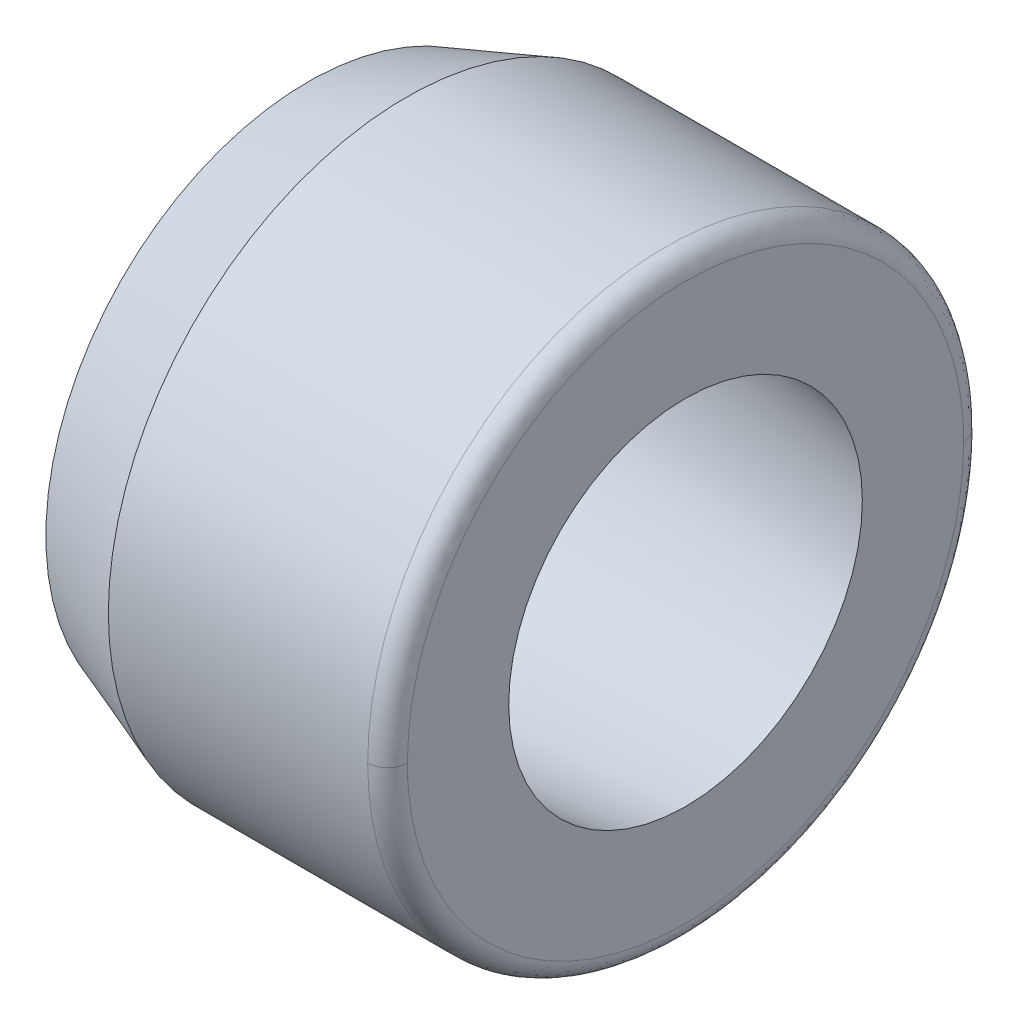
ISO-10303-21;
HEADER;
FILE_DESCRIPTION(('STEP AP214'),'2;1');
FILE_NAME('part.step','',(''),(''),'','','');
FILE_SCHEMA(('AUTOMOTIVE_DESIGN { 1 0 10303 214 1 1 1 1 }'));
ENDSEC;
DATA;
#1=APPLICATION_CONTEXT('core data for automotive mechanical design processes');
#2=APPLICATION_PROTOCOL_DEFINITION('international standard','automotive_design',2000,#1);
#3=PRODUCT_CONTEXT('',#1,'mechanical');
#4=PRODUCT('Part','Part','',(#3));
#5=PRODUCT_RELATED_PRODUCT_CATEGORY('part','',(#4));
#6=PRODUCT_DEFINITION_FORMATION('','',#4);
#7=PRODUCT_DEFINITION_CONTEXT('part definition',#1,'design');
#8=PRODUCT_DEFINITION('design','',#6,#7);
#9=PRODUCT_DEFINITION_SHAPE('','',#8);
#10=(LENGTH_UNIT() NAMED_UNIT(*) SI_UNIT(.MILLI.,.METRE.));
#11=(NAMED_UNIT(*) PLANE_ANGLE_UNIT() SI_UNIT($,.RADIAN.));
#12=(NAMED_UNIT(*) SI_UNIT($,.STERADIAN.) SOLID_ANGLE_UNIT());
#13=UNCERTAINTY_MEASURE_WITH_UNIT(LENGTH_MEASURE(1.E-05),#10,'distance_accuracy_value','');
#14=(GEOMETRIC_REPRESENTATION_CONTEXT(3) GLOBAL_UNCERTAINTY_ASSIGNED_CONTEXT((#13)) GLOBAL_UNIT_ASSIGNED_CONTEXT((#10,
#11,#12)) REPRESENTATION_CONTEXT('',''));
#15=CARTESIAN_POINT('',(0.,0.,0.));
#16=DIRECTION('',(0.,0.,1.));
#17=DIRECTION('',(1.,0.,0.));
#18=AXIS2_PLACEMENT_3D('',#15,#16,#17);
#19=CARTESIAN_POINT('',(0.320167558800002,0.,0.));
#20=DIRECTION('',(-1.,0.,0.));
#21=DIRECTION('',(0.,0.,1.));
#22=AXIS2_PLACEMENT_3D('',#19,#20,#21);
#23=CONICAL_SURFACE('',#22,1.3899511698,0.523598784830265);
#24=CARTESIAN_POINT('',(0.,0.,0.));
#25=DIRECTION('',(-1.,0.,0.));
#26=DIRECTION('',(0.,0.,1.));
#27=AXIS2_PLACEMENT_3D('',#24,#25,#26);
#28=CIRCLE('',#27,1.5748);
#29=CARTESIAN_POINT('',(0.,0.,1.5748));
#30=VERTEX_POINT('',#29);
#31=EDGE_CURVE('E21',#30,#30,#28,.F.);
#32=ORIENTED_EDGE('',*,*,#31,.F.);
#33=EDGE_LOOP('',(#32));
#34=FACE_BOUND('',#33,.T.);
#35=CARTESIAN_POINT('',(0.320167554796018,0.,0.));
#36=DIRECTION('',(-1.,0.,0.));
#37=DIRECTION('',(0.,-1.,0.));
#38=AXIS2_PLACEMENT_3D('',#35,#36,#37);
#39=CIRCLE('',#38,1.38995116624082);
#40=CARTESIAN_POINT('',(0.320167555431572,-1.42541794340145E-10,-1.38995116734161));
#41=VERTEX_POINT('',#40);
#42=CARTESIAN_POINT('',(0.32016755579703,-6.24045086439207E-11,1.3899511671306));
#43=VERTEX_POINT('',#42);
#44=EDGE_CURVE('E66',#41,#43,#39,.T.);
#45=ORIENTED_EDGE('',*,*,#44,.F.);
#46=CARTESIAN_POINT('',(0.320167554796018,0.,0.));
#47=DIRECTION('',(-1.,0.,0.));
#48=DIRECTION('',(0.,-1.,0.));
#49=AXIS2_PLACEMENT_3D('',#46,#47,#48);
#50=CIRCLE('',#49,1.38995116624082);
#51=EDGE_CURVE('E55',#43,#41,#50,.T.);
#52=ORIENTED_EDGE('',*,*,#51,.F.);
#53=EDGE_LOOP('',(#45,#52));
#54=FACE_BOUND('',#53,.T.);
#55=ADVANCED_FACE('F16',(#34,#54),#23,.F.);
#56=CARTESIAN_POINT('',(0.,-1.6965168,-1.6965168));
#57=DIRECTION('',(-1.,0.,0.));
#58=DIRECTION('',(0.,0.,1.));
#59=AXIS2_PLACEMENT_3D('',#56,#57,#58);
#60=PLANE('',#59);
#61=ORIENTED_EDGE('',*,*,#31,.T.);
#62=EDGE_LOOP('',(#61));
#63=FACE_BOUND('',#62,.T.);
#64=CARTESIAN_POINT('',(0.,0.,0.));
#65=DIRECTION('',(1.,0.,0.));
#66=DIRECTION('',(0.,0.,-1.));
#67=AXIS2_PLACEMENT_3D('',#64,#65,#66);
#68=CIRCLE('',#67,1.6764);
#69=CARTESIAN_POINT('',(0.,0.,-1.6764));
#70=VERTEX_POINT('',#69);
#71=EDGE_CURVE('E125',#70,#70,#68,.F.);
#72=ORIENTED_EDGE('',*,*,#71,.T.);
#73=EDGE_LOOP('',(#72));
#74=FACE_BOUND('',#73,.T.);
#75=ADVANCED_FACE('F195',(#63,#74),#60,.T.);
#76=CARTESIAN_POINT('',(0.443752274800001,0.,1.355944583));
#77=CARTESIAN_POINT('',(0.443752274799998,2.711889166,1.355944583));
#78=CARTESIAN_POINT('',(0.443752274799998,2.711889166,-1.355944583));
#79=CARTESIAN_POINT('',(0.443752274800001,0.,-1.355944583));
#80=CARTESIAN_POINT('',(0.391279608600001,0.,1.356650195));
#81=CARTESIAN_POINT('',(0.391279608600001,2.71330039,1.356650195));
#82=CARTESIAN_POINT('',(0.391279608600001,2.71330039,-1.356650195));
#83=CARTESIAN_POINT('',(0.391279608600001,0.,-1.356650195));
#84=CARTESIAN_POINT('',(0.341441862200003,0.,1.3730842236));
#85=CARTESIAN_POINT('',(0.341441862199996,2.7461684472,1.3730842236));
#86=CARTESIAN_POINT('',(0.341441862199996,2.7461684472,-1.3730842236));
#87=CARTESIAN_POINT('',(0.341441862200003,0.,-1.3730842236));
#88=CARTESIAN_POINT('',(0.298841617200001,0.,1.4037289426));
#89=CARTESIAN_POINT('',(0.298841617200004,2.8074579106,1.4037289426));
#90=CARTESIAN_POINT('',(0.298841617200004,2.8074579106,-1.4037289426));
#91=CARTESIAN_POINT('',(0.298841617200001,0.,-1.4037289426));
#92=(BOUNDED_SURFACE() B_SPLINE_SURFACE(3,3,((#76,#77,#78,#79),(#80,#81,#82,#83),(#84,#85,#86,
#87),(#88,#89,#90,#91)),.UNSPECIFIED.,.F.,.F.,.F.) B_SPLINE_SURFACE_WITH_KNOTS((4,4),(4,4),(0.,
1.),(0.,1.),.UNSPECIFIED.) GEOMETRIC_REPRESENTATION_ITEM() RATIONAL_B_SPLINE_SURFACE(((1.,
0.333333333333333,0.333333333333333,1.),(0.969216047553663,0.323072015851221,0.323072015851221,
0.969216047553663),(0.969216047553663,0.323072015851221,0.323072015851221,0.969216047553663),
(1.,0.333333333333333,0.333333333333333,1.))) REPRESENTATION_ITEM('') SURFACE());
#93=CARTESIAN_POINT('',(0.418413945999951,0.,0.));
#94=DIRECTION('',(-1.,0.,0.));
#95=DIRECTION('',(0.,0.,1.));
#96=AXIS2_PLACEMENT_3D('',#93,#94,#95);
#97=CIRCLE('',#96,1.3575543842);
#98=CARTESIAN_POINT('',(0.418413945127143,-1.82849395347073E-10,1.35755438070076));
#99=VERTEX_POINT('',#98);
#100=CARTESIAN_POINT('',(0.418413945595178,-4.17658529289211E-10,-1.35755438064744));
#101=VERTEX_POINT('',#100);
#102=EDGE_CURVE('E135',#99,#101,#97,.T.);
#103=CARTESIAN_POINT('',(0.443752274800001,0.,1.355944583));
#104=CARTESIAN_POINT('',(0.391279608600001,0.,1.356650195));
#105=CARTESIAN_POINT('',(0.341441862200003,0.,1.3730842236));
#106=CARTESIAN_POINT('',(0.298841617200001,0.,1.4037289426));
#107=(BOUNDED_CURVE() B_SPLINE_CURVE(3,(#103,#104,#105,#106),.UNSPECIFIED.,.F.,
.F.) B_SPLINE_CURVE_WITH_KNOTS((4,4),(0.,1.),
.UNSPECIFIED.) CURVE() GEOMETRIC_REPRESENTATION_ITEM() RATIONAL_B_SPLINE_CURVE((1.,
0.969216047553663,0.969216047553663,1.)) REPRESENTATION_ITEM(''));
#108=EDGE_CURVE('E63',#43,#99,#107,.F.);
#109=CARTESIAN_POINT('',(0.443752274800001,0.,-1.355944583));
#110=CARTESIAN_POINT('',(0.391279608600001,0.,-1.356650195));
#111=CARTESIAN_POINT('',(0.341441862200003,0.,-1.3730842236));
#112=CARTESIAN_POINT('',(0.298841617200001,0.,-1.4037289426));
#113=(BOUNDED_CURVE() B_SPLINE_CURVE(3,(#109,#110,#111,#112),.UNSPECIFIED.,.F.,
.F.) B_SPLINE_CURVE_WITH_KNOTS((4,4),(0.,1.),
.UNSPECIFIED.) CURVE() GEOMETRIC_REPRESENTATION_ITEM() RATIONAL_B_SPLINE_CURVE((1.,
0.969216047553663,0.969216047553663,1.)) REPRESENTATION_ITEM(''));
#114=EDGE_CURVE('E60',#101,#41,#113,.T.);
#115=ORIENTED_EDGE('',*,*,#102,.F.);
#116=ORIENTED_EDGE('',*,*,#108,.F.);
#117=ORIENTED_EDGE('',*,*,#51,.T.);
#118=ORIENTED_EDGE('',*,*,#114,.F.);
#119=EDGE_LOOP('',(#115,#116,#117,#118));
#120=FACE_BOUND('',#119,.T.);
#121=ADVANCED_FACE('F58',(#120),#92,.T.);
#122=CARTESIAN_POINT('',(0.443752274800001,0.,-1.355944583));
#123=CARTESIAN_POINT('',(0.443752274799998,-2.711889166,-1.355944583));
#124=CARTESIAN_POINT('',(0.443752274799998,-2.711889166,1.355944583));
#125=CARTESIAN_POINT('',(0.443752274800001,0.,1.355944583));
#126=CARTESIAN_POINT('',(0.391279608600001,0.,-1.356650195));
#127=CARTESIAN_POINT('',(0.391279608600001,-2.71330039,-1.356650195));
#128=CARTESIAN_POINT('',(0.391279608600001,-2.71330039,1.356650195));
#129=CARTESIAN_POINT('',(0.391279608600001,0.,1.356650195));
#130=CARTESIAN_POINT('',(0.341441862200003,0.,-1.3730842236));
#131=CARTESIAN_POINT('',(0.341441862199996,-2.7461684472,-1.3730842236));
#132=CARTESIAN_POINT('',(0.341441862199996,-2.7461684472,1.3730842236));
#133=CARTESIAN_POINT('',(0.341441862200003,0.,1.3730842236));
#134=CARTESIAN_POINT('',(0.298841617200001,0.,-1.4037289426));
#135=CARTESIAN_POINT('',(0.298841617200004,-2.8074579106,-1.4037289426));
#136=CARTESIAN_POINT('',(0.298841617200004,-2.8074579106,1.4037289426));
#137=CARTESIAN_POINT('',(0.298841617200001,0.,1.4037289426));
#138=(BOUNDED_SURFACE() B_SPLINE_SURFACE(3,3,((#122,#123,#124,#125),(#126,#127,#128,#129),(#130,
#131,#132,#133),(#134,#135,#136,#137)),.UNSPECIFIED.,.F.,.F.,
.F.) B_SPLINE_SURFACE_WITH_KNOTS((4,4),(4,4),(0.,1.),(0.,1.),
.UNSPECIFIED.) GEOMETRIC_REPRESENTATION_ITEM() RATIONAL_B_SPLINE_SURFACE(((1.,0.333333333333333,
0.333333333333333,1.),(0.969216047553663,0.323072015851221,0.323072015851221,0.969216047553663),
(0.969216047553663,0.323072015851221,0.323072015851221,0.969216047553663),(1.,0.333333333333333,
0.333333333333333,1.))) REPRESENTATION_ITEM('') SURFACE());
#139=CARTESIAN_POINT('',(0.418413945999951,0.,0.));
#140=DIRECTION('',(-1.,0.,0.));
#141=DIRECTION('',(0.,0.,1.));
#142=AXIS2_PLACEMENT_3D('',#139,#140,#141);
#143=CIRCLE('',#142,1.3575543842);
#144=EDGE_CURVE('E72',#101,#99,#143,.T.);
#145=ORIENTED_EDGE('',*,*,#108,.T.);
#146=ORIENTED_EDGE('',*,*,#144,.F.);
#147=ORIENTED_EDGE('',*,*,#114,.T.);
#148=ORIENTED_EDGE('',*,*,#44,.T.);
#149=EDGE_LOOP('',(#145,#146,#147,#148));
#150=FACE_BOUND('',#149,.T.);
#151=ADVANCED_FACE('F70',(#150),#138,.T.);
#152=CARTESIAN_POINT('',(0.,0.,0.));
#153=DIRECTION('',(1.,0.,0.));
#154=DIRECTION('',(0.,0.,-1.));
#155=AXIS2_PLACEMENT_3D('',#152,#153,#154);
#156=CONICAL_SURFACE('',#155,1.6764,0.349065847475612);
#157=ORIENTED_EDGE('',*,*,#71,.F.);
#158=EDGE_LOOP('',(#157));
#159=FACE_BOUND('',#158,.T.);
#160=CARTESIAN_POINT('',(0.628073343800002,0.,0.));
#161=DIRECTION('',(-1.,0.,0.));
#162=DIRECTION('',(0.,0.,1.));
#163=AXIS2_PLACEMENT_3D('',#160,#161,#162);
#164=CIRCLE('',#163,1.905);
#165=CARTESIAN_POINT('',(0.628073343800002,0.,1.905));
#166=VERTEX_POINT('',#165);
#167=EDGE_CURVE('E100',#166,#166,#164,.T.);
#168=ORIENTED_EDGE('',*,*,#167,.T.);
#169=EDGE_LOOP('',(#168));
#170=FACE_BOUND('',#169,.T.);
#171=ADVANCED_FACE('F172',(#159,#170),#156,.T.);
#172=CARTESIAN_POINT('',(2.4123655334,0.,1.7653211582));
#173=CARTESIAN_POINT('',(2.4123655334,-3.5306423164,1.7653211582));
#174=CARTESIAN_POINT('',(2.4123655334,-3.5306423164,-1.7653211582));
#175=CARTESIAN_POINT('',(2.4123655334,0.,-1.7653211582));
#176=CARTESIAN_POINT('',(2.4210289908,0.,1.8516668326));
#177=CARTESIAN_POINT('',(2.4210289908,-3.7033336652,1.8516668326));
#178=CARTESIAN_POINT('',(2.4210289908,-3.7033336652,-1.8516668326));
#179=CARTESIAN_POINT('',(2.4210289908,0.,-1.8516668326));
#180=CARTESIAN_POINT('',(2.3596668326,0.,1.9130289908));
#181=CARTESIAN_POINT('',(2.3596668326,-3.8260579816,1.9130289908));
#182=CARTESIAN_POINT('',(2.3596668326,-3.8260579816,-1.9130289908));
#183=CARTESIAN_POINT('',(2.3596668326,0.,-1.9130289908));
#184=CARTESIAN_POINT('',(2.2733211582,0.,1.9043655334));
#185=CARTESIAN_POINT('',(2.27332115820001,-3.8087310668,1.9043655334));
#186=CARTESIAN_POINT('',(2.27332115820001,-3.8087310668,-1.9043655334));
#187=CARTESIAN_POINT('',(2.2733211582,0.,-1.9043655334));
#188=(BOUNDED_SURFACE() B_SPLINE_SURFACE(3,3,((#172,#173,#174,#175),(#176,#177,#178,#179),(#180,
#181,#182,#183),(#184,#185,#186,#187)),.UNSPECIFIED.,.F.,.F.,
.F.) B_SPLINE_SURFACE_WITH_KNOTS((4,4),(4,4),(0.,1.),(0.,1.),
.UNSPECIFIED.) GEOMETRIC_REPRESENTATION_ITEM() RATIONAL_B_SPLINE_SURFACE(((1.,0.333333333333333,
0.333333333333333,1.),(0.755320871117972,0.251773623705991,0.251773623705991,0.755320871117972),
(0.755320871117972,0.251773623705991,0.251773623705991,0.755320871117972),(1.,0.333333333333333,
0.333333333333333,1.))) REPRESENTATION_ITEM('') SURFACE());
#189=CARTESIAN_POINT('',(2.4123655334,0.,-1.7653211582));
#190=CARTESIAN_POINT('',(2.4210289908,0.,-1.8516668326));
#191=CARTESIAN_POINT('',(2.3596668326,0.,-1.9130289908));
#192=CARTESIAN_POINT('',(2.2733211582,0.,-1.9043655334));
#193=(BOUNDED_CURVE() B_SPLINE_CURVE(3,(#189,#190,#191,#192),.UNSPECIFIED.,.F.,
.F.) B_SPLINE_CURVE_WITH_KNOTS((4,4),(0.,1.),
.UNSPECIFIED.) CURVE() GEOMETRIC_REPRESENTATION_ITEM() RATIONAL_B_SPLINE_CURVE((1.,
0.755320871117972,0.755320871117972,1.)) REPRESENTATION_ITEM(''));
#194=CARTESIAN_POINT('',(2.28600000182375,-1.95361088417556E-10,-1.90500000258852));
#195=VERTEX_POINT('',#194);
#196=CARTESIAN_POINT('',(2.41300000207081,0.,-1.77800000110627));
#197=VERTEX_POINT('',#196);
#198=EDGE_CURVE('E35',#195,#197,#193,.F.);
#199=CARTESIAN_POINT('',(2.41300000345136,0.,-1.77800000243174));
#200=CARTESIAN_POINT('',(2.41300000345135,-3.55600000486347,-1.77800000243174));
#201=CARTESIAN_POINT('',(2.41300000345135,-3.55600000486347,1.77800000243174));
#202=CARTESIAN_POINT('',(2.41300000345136,0.,1.77800000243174));
#203=(BOUNDED_CURVE() B_SPLINE_CURVE(3,(#199,#200,#201,#202),.UNSPECIFIED.,.F.,
.F.) B_SPLINE_CURVE_WITH_KNOTS((4,4),(0.,1.),
.UNSPECIFIED.) CURVE() GEOMETRIC_REPRESENTATION_ITEM() RATIONAL_B_SPLINE_CURVE((0.956578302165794,
0.318859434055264,0.318859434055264,0.956578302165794)) REPRESENTATION_ITEM(''));
#204=CARTESIAN_POINT('',(2.41300000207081,0.,1.77800000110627));
#205=VERTEX_POINT('',#204);
#206=EDGE_CURVE('E103',#205,#197,#203,.F.);
#207=CARTESIAN_POINT('',(2.4123655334,0.,1.7653211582));
#208=CARTESIAN_POINT('',(2.4210289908,0.,1.8516668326));
#209=CARTESIAN_POINT('',(2.3596668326,0.,1.9130289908));
#210=CARTESIAN_POINT('',(2.2733211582,0.,1.9043655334));
#211=(BOUNDED_CURVE() B_SPLINE_CURVE(3,(#207,#208,#209,#210),.UNSPECIFIED.,.F.,
.F.) B_SPLINE_CURVE_WITH_KNOTS((4,4),(0.,1.),
.UNSPECIFIED.) CURVE() GEOMETRIC_REPRESENTATION_ITEM() RATIONAL_B_SPLINE_CURVE((1.,
0.755320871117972,0.755320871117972,1.)) REPRESENTATION_ITEM(''));
#212=CARTESIAN_POINT('',(2.28600000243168,-8.55283725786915E-11,1.90500000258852));
#213=VERTEX_POINT('',#212);
#214=EDGE_CURVE('E93',#205,#213,#211,.T.);
#215=CARTESIAN_POINT('',(2.28600000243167,0.,0.));
#216=DIRECTION('',(1.,0.,0.));
#217=DIRECTION('',(0.,1.,0.));
#218=AXIS2_PLACEMENT_3D('',#215,#216,#217);
#219=CIRCLE('',#218,1.90500000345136);
#220=EDGE_CURVE('E91',#213,#195,#219,.T.);
#221=ORIENTED_EDGE('',*,*,#198,.T.);
#222=ORIENTED_EDGE('',*,*,#206,.F.);
#223=ORIENTED_EDGE('',*,*,#214,.T.);
#224=ORIENTED_EDGE('',*,*,#220,.T.);
#225=EDGE_LOOP('',(#221,#222,#223,#224));
#226=FACE_BOUND('',#225,.T.);
#227=ADVANCED_FACE('F159',(#226),#188,.T.);
#228=CARTESIAN_POINT('',(2.413,0.,0.));
#229=DIRECTION('',(-1.,0.,0.));
#230=DIRECTION('',(0.,0.,1.));
#231=AXIS2_PLACEMENT_3D('',#228,#229,#230);
#232=CONICAL_SURFACE('',#231,1.1303,0.113446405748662);
#233=ORIENTED_EDGE('',*,*,#102,.T.);
#234=ORIENTED_EDGE('',*,*,#144,.T.);
#235=EDGE_LOOP('',(#233,#234));
#236=FACE_BOUND('',#235,.T.);
#237=CARTESIAN_POINT('',(2.413,0.,0.));
#238=DIRECTION('',(-1.,0.,0.));
#239=DIRECTION('',(0.,0.,1.));
#240=AXIS2_PLACEMENT_3D('',#237,#238,#239);
#241=CIRCLE('',#240,1.1303);
#242=CARTESIAN_POINT('',(2.413,0.,1.1303));
#243=VERTEX_POINT('',#242);
#244=EDGE_CURVE('E88',#243,#243,#241,.T.);
#245=ORIENTED_EDGE('',*,*,#244,.F.);
#246=EDGE_LOOP('',(#245));
#247=FACE_BOUND('',#246,.T.);
#248=ADVANCED_FACE('F171',(#236,#247),#232,.F.);
#249=CARTESIAN_POINT('',(2.286,0.,0.));
#250=DIRECTION('',(-1.,0.,0.));
#251=DIRECTION('',(0.,0.,1.));
#252=AXIS2_PLACEMENT_3D('',#249,#250,#251);
#253=CYLINDRICAL_SURFACE('',#252,1.905);
#254=ORIENTED_EDGE('',*,*,#220,.F.);
#255=CARTESIAN_POINT('',(2.28600000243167,0.,0.));
#256=DIRECTION('',(1.,0.,0.));
#257=DIRECTION('',(0.,1.,0.));
#258=AXIS2_PLACEMENT_3D('',#255,#256,#257);
#259=CIRCLE('',#258,1.90500000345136);
#260=EDGE_CURVE('E27',#195,#213,#259,.T.);
#261=ORIENTED_EDGE('',*,*,#260,.F.);
#262=EDGE_LOOP('',(#254,#261));
#263=FACE_BOUND('',#262,.T.);
#264=ORIENTED_EDGE('',*,*,#167,.F.);
#265=EDGE_LOOP('',(#264));
#266=FACE_BOUND('',#265,.T.);
#267=ADVANCED_FACE('F216',(#263,#266),#253,.T.);
#268=CARTESIAN_POINT('',(2.413,-1.799336,1.799336));
#269=DIRECTION('',(1.,0.,0.));
#270=DIRECTION('',(0.,0.,-1.));
#271=AXIS2_PLACEMENT_3D('',#268,#269,#270);
#272=PLANE('',#271);
#273=ORIENTED_EDGE('',*,*,#244,.T.);
#274=EDGE_LOOP('',(#273));
#275=FACE_BOUND('',#274,.T.);
#276=CARTESIAN_POINT('',(2.41300000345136,0.,1.77800000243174));
#277=CARTESIAN_POINT('',(2.41300000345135,3.55600000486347,1.77800000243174));
#278=CARTESIAN_POINT('',(2.41300000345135,3.55600000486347,-1.77800000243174));
#279=CARTESIAN_POINT('',(2.41300000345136,0.,-1.77800000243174));
#280=(BOUNDED_CURVE() B_SPLINE_CURVE(3,(#276,#277,#278,#279),.UNSPECIFIED.,.F.,
.F.) B_SPLINE_CURVE_WITH_KNOTS((4,4),(0.,1.),
.UNSPECIFIED.) CURVE() GEOMETRIC_REPRESENTATION_ITEM() RATIONAL_B_SPLINE_CURVE((0.956578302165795,
0.318859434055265,0.318859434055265,0.956578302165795)) REPRESENTATION_ITEM(''));
#281=EDGE_CURVE('E11',#205,#197,#280,.T.);
#282=ORIENTED_EDGE('',*,*,#281,.F.);
#283=ORIENTED_EDGE('',*,*,#206,.T.);
#284=EDGE_LOOP('',(#282,#283));
#285=FACE_BOUND('',#284,.T.);
#286=ADVANCED_FACE('F18',(#275,#285),#272,.T.);
#287=CARTESIAN_POINT('',(2.4123655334,0.,-1.7653211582));
#288=CARTESIAN_POINT('',(2.4123655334,3.5306423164,-1.7653211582));
#289=CARTESIAN_POINT('',(2.4123655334,3.5306423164,1.7653211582));
#290=CARTESIAN_POINT('',(2.4123655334,0.,1.7653211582));
#291=CARTESIAN_POINT('',(2.4210289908,0.,-1.8516668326));
#292=CARTESIAN_POINT('',(2.4210289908,3.7033336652,-1.8516668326));
#293=CARTESIAN_POINT('',(2.4210289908,3.7033336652,1.8516668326));
#294=CARTESIAN_POINT('',(2.4210289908,0.,1.8516668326));
#295=CARTESIAN_POINT('',(2.3596668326,0.,-1.9130289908));
#296=CARTESIAN_POINT('',(2.3596668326,3.8260579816,-1.9130289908));
#297=CARTESIAN_POINT('',(2.3596668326,3.8260579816,1.9130289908));
#298=CARTESIAN_POINT('',(2.3596668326,0.,1.9130289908));
#299=CARTESIAN_POINT('',(2.2733211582,0.,-1.9043655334));
#300=CARTESIAN_POINT('',(2.27332115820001,3.8087310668,-1.9043655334));
#301=CARTESIAN_POINT('',(2.27332115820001,3.8087310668,1.9043655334));
#302=CARTESIAN_POINT('',(2.2733211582,0.,1.9043655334));
#303=(BOUNDED_SURFACE() B_SPLINE_SURFACE(3,3,((#287,#288,#289,#290),(#291,#292,#293,#294),(#295,
#296,#297,#298),(#299,#300,#301,#302)),.UNSPECIFIED.,.F.,.F.,
.F.) B_SPLINE_SURFACE_WITH_KNOTS((4,4),(4,4),(0.,1.),(0.,1.),
.UNSPECIFIED.) GEOMETRIC_REPRESENTATION_ITEM() RATIONAL_B_SPLINE_SURFACE(((1.,0.333333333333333,
0.333333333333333,1.),(0.755320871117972,0.251773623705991,0.251773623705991,0.755320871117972),
(0.755320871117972,0.251773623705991,0.251773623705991,0.755320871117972),(1.,0.333333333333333,
0.333333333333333,1.))) REPRESENTATION_ITEM('') SURFACE());
#304=ORIENTED_EDGE('',*,*,#281,.T.);
#305=ORIENTED_EDGE('',*,*,#198,.F.);
#306=ORIENTED_EDGE('',*,*,#260,.T.);
#307=ORIENTED_EDGE('',*,*,#214,.F.);
#308=EDGE_LOOP('',(#304,#305,#306,#307));
#309=FACE_BOUND('',#308,.T.);
#310=ADVANCED_FACE('F209',(#309),#303,.T.);
#311=CLOSED_SHELL('',(#55,#75,#121,#151,#171,#227,#248,#267,#286,#310));
#312=MANIFOLD_SOLID_BREP('B1',#311);
#313=ADVANCED_BREP_SHAPE_REPRESENTATION('',(#18,#312),#14);
#314=SHAPE_DEFINITION_REPRESENTATION(#9,#313);
ENDSEC;
END-ISO-10303-21;
